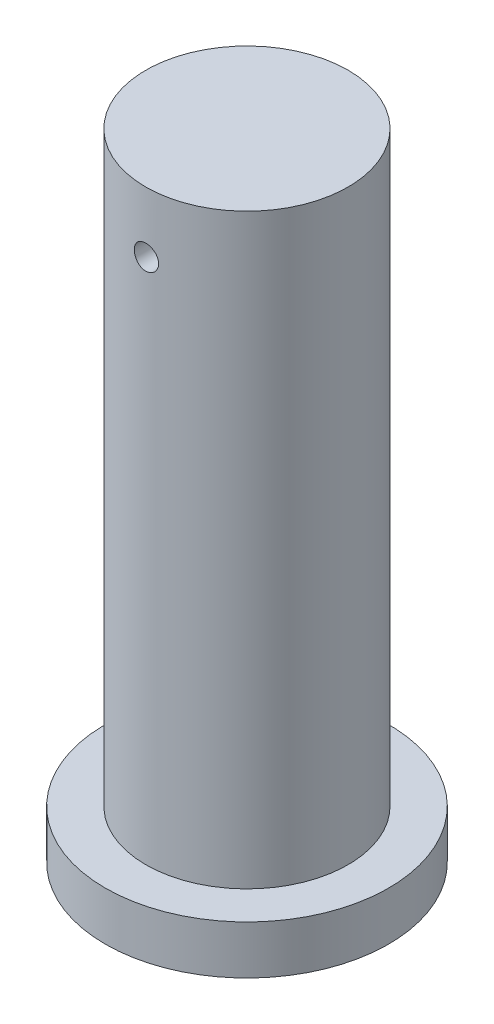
from build123d import *

# Parameters (mm, degrees)
CUT_EXTRUDE1_DEPTH      = 165.61773902
CUT_EXTRUDE1_DEPTH_BACK = 165.61773902
SKETCH2_R               = 3


with BuildPart() as part:
    # Sketch1 → Revolve1 (revolve)
    with BuildSketch(Plane.YZ):
        Polygon((0, 0), (-157, 0), (-157, 35), (-145, 35), (-145, 25), (0, 25), align=None)
    revolve(axis=Axis((0, 0, 0), (0, -1, 0)))

    # Sketch2 → Cut-Extrude1 (cut, two sides: drawn at the far end of the back side and taken through both)
    with BuildSketch(Plane(origin=(0, 0, 0), x_dir=(0, 1, 0), z_dir=(0, 0, 1)).offset(-CUT_EXTRUDE1_DEPTH_BACK)):
        with Locations(Location((-15, 0, 0), (0, 0, 270))):
            Circle(SKETCH2_R)
    extrude(amount=CUT_EXTRUDE1_DEPTH + CUT_EXTRUDE1_DEPTH_BACK, mode=Mode.SUBTRACT)


solid = part.part
